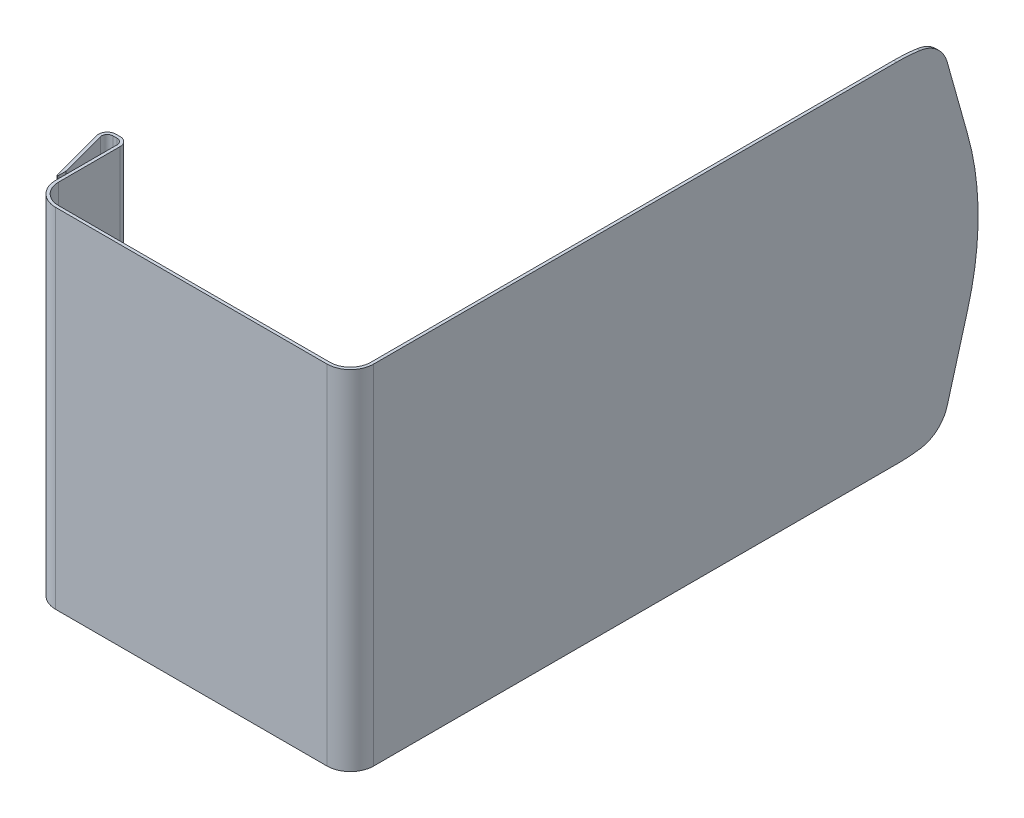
from build123d import *

# Parameters (mm, degrees)
SKETCH1_W           = 372.126511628
SKETCH1_H           = 554
BOSS_EXTRUDE1_DEPTH = 3.175
BOSS_EXTRUDE2_DEPTH = 186.063255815
BOSS_EXTRUDE3_DEPTH = 3.175


with BuildPart() as part:
    # Sketch1 → Boss-Extrude1 (new body)
    with BuildSketch(Plane.YZ):
        Rectangle(SKETCH1_W, SKETCH1_H)
    extrude(amount=BOSS_EXTRUDE1_DEPTH)

    # Sketch2 → Boss-Extrude2 (add, symmetric)
    with BuildSketch(Plane(origin=(0, 0, 0), x_dir=(-1, 0, 0), z_dir=(0, 1, 0))):
        with BuildLine():
            Line((0, 277), (0, 282))
            ThreePointArc((0, 282), (6.392394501, 297.432605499), (21.825, 303.825))
            Line((21.825, 303.825), (311.825, 303.825))
            ThreePointArc((311.825, 303.825), (327.257605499, 297.432605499), (333.65, 282))
            Line((333.65, 282), (333.65, 216.175))
            ThreePointArc((333.65, 216.175), (336.337295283, 209.687295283), (342.825, 207))
            Line((342.825, 207), (347.457699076, 207))
            ThreePointArc((347.457699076, 207), (354.736715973, 210.589613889), (356.320068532, 218.549664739))
            Line((356.320068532, 218.549664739), (340.790925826, 276.505214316))
            Line((340.790925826, 276.505214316), (340.566180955, 276.444994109))
            ThreePointArc((340.566180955, 276.444994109), (340.03164666, 276.087829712), (339.825, 275.479068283))
            Line((339.825, 275.479068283), (339.825, 267.97449308))
            ThreePointArc((339.825, 267.97449308), (339.833555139, 267.843966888), (339.859074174, 267.715674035))
            Line((339.859074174, 267.715674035), (353.253254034, 217.727914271))
            ThreePointArc((353.253254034, 217.727914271), (352.217819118, 212.522431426), (347.457699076, 210.175))
            Line((347.457699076, 210.175), (342.825, 210.175))
            ThreePointArc((342.825, 210.175), (338.582359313, 211.932359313), (336.825, 216.175))
            Line((336.825, 216.175), (336.825, 282))
            ThreePointArc((336.825, 282), (329.50266953, 299.67766953), (311.825, 307))
            Line((311.825, 307), (21.825, 307))
            ThreePointArc((21.825, 307), (4.14733047, 299.67766953), (-3.175, 282))
            Line((-3.175, 282), (-3.175, 277))
            Line((-3.175, 277), (0, 277))
        make_face()
    extrude(amount=BOSS_EXTRUDE2_DEPTH, both=True)

    # Sketch3 → Boss-Extrude3 (add)
    with BuildSketch(Plane.YZ):
        with BuildLine():
            Line((-159.149882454, -330.923346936), (-80.968066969, -352.837339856))
            ThreePointArc((-80.968066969, -352.837339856), (0, -363.970290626), (80.968066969, -352.837339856))
            Line((80.968066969, -352.837339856), (159.149882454, -330.923346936))
            ThreePointArc((159.149882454, -330.923346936), (176.111408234, -320.1923476), (184.388589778, -301.907491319))
            ThreePointArc((184.388589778, -301.907491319), (185.644117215, -289.481863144), (186.063255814, -277))
            Line((186.063255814, -277), (-186.063255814, -277))
            ThreePointArc((-186.063255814, -277), (-185.644117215, -289.481863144), (-184.388589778, -301.907491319))
            ThreePointArc((-184.388589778, -301.907491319), (-176.111408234, -320.1923476), (-159.149882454, -330.923346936))
        make_face()
    extrude(amount=BOSS_EXTRUDE3_DEPTH)


solid = part.part
